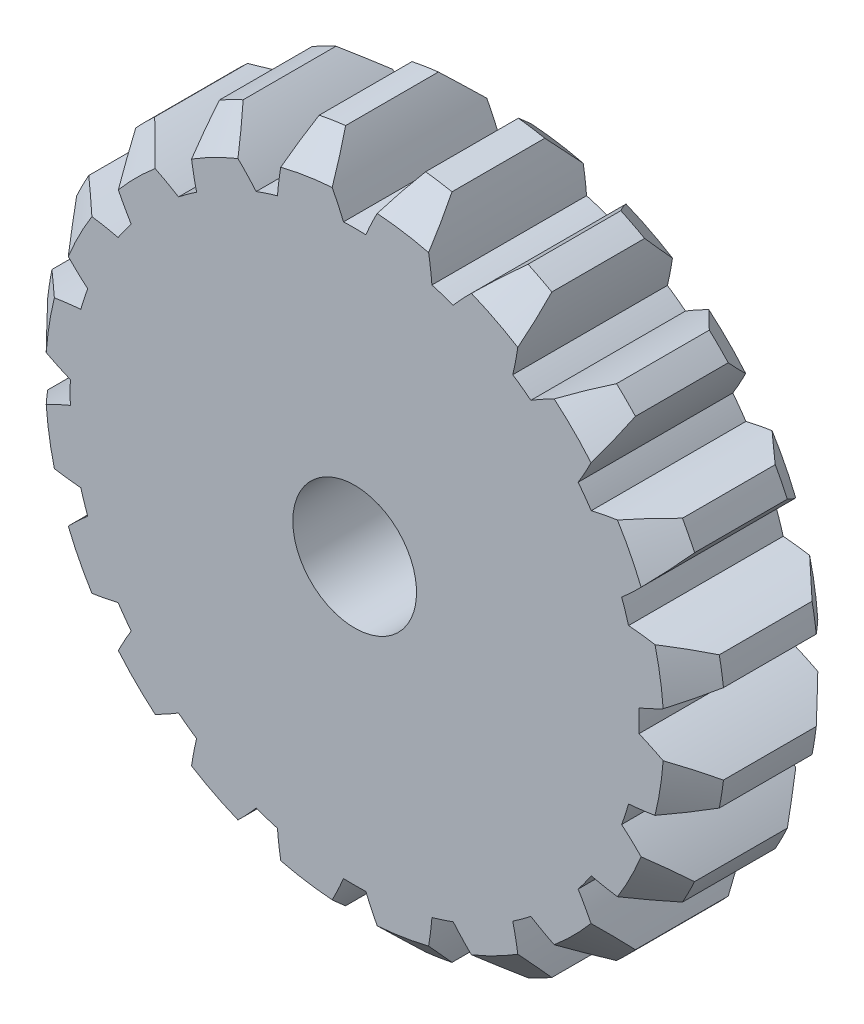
from build123d import *

# Parameters (mm, degrees)
SKETCH1_R               = 11
GEAR_BLANK_DEPTH        = 2.5
FRONT_GEAR_CHAMFER_SIZE = 1
REAR_GEAR_CHAMFER_SIZE  = 1
TOOTH_CUT_DEPTH         = 2.5
TOOTH_COPIES_COUNT      = 20
SKETCH4_R               = 2
EXTRUDE1_DEPTH          = 17.237511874


with BuildPart() as part:
    # Sketch1 → Gear Blank (new, symmetric)
    with BuildSketch(Plane.XY):
        Circle(SKETCH1_R)
    extrude(amount=GEAR_BLANK_DEPTH, both=True)

    # Front Gear Chamfer
    front_gear_chamfer_edges = [part.edges().sort_by_distance(p)[0] for p in [
        (-11, 0, 2.5),
    ]]
    chamfer(front_gear_chamfer_edges, length=FRONT_GEAR_CHAMFER_SIZE)

    # Rear Gear Chamfer
    rear_gear_chamfer_edges = [part.edges().sort_by_distance(p)[0] for p in [
        (-11, 0, -2.5),
    ]]
    chamfer(rear_gear_chamfer_edges, length=REAR_GEAR_CHAMFER_SIZE)

    # Sketch2 → Tooth Cut (cut, symmetric)
    with BuildSketch(Plane.XY):
        with BuildLine():
            ThreePointArc((1.292906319, 10.923753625), (-5.089e-06, 11), (-1.292916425, 10.923752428))
            ThreePointArc((-1.292916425, 10.923752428), (-0.784423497, 10.081278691), (-0.361194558, 9.192906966))
            ThreePointArc((-0.361194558, 9.192906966), (-4.256e-06, 9.2), (0.361186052, 9.192907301))
            ThreePointArc((0.361186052, 9.192907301), (0.78441417, 10.081279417), (1.292906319, 10.923753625))
        make_face()
    tooth_cut = extrude(amount=TOOTH_CUT_DEPTH, both=True, mode=Mode.SUBTRACT)

    # Tooth Copies: Tooth Cut ×20 about axis
    tooth_copies_axis = Axis((0, 0, 0), (0, 0, 1))
    for i in range(1, TOOTH_COPIES_COUNT):
        add(tooth_cut.rotate(tooth_copies_axis, i * 360 / TOOTH_COPIES_COUNT), mode=Mode.SUBTRACT)

    # Sketch4 → Extrude1 (cut, through all)
    with BuildSketch(Plane(origin=(0, 0, -2.5), x_dir=(-1, 0, 0), z_dir=(0, 0, -1))):
        Circle(SKETCH4_R)
    extrude(amount=-EXTRUDE1_DEPTH, mode=Mode.SUBTRACT)


solid = part.part
